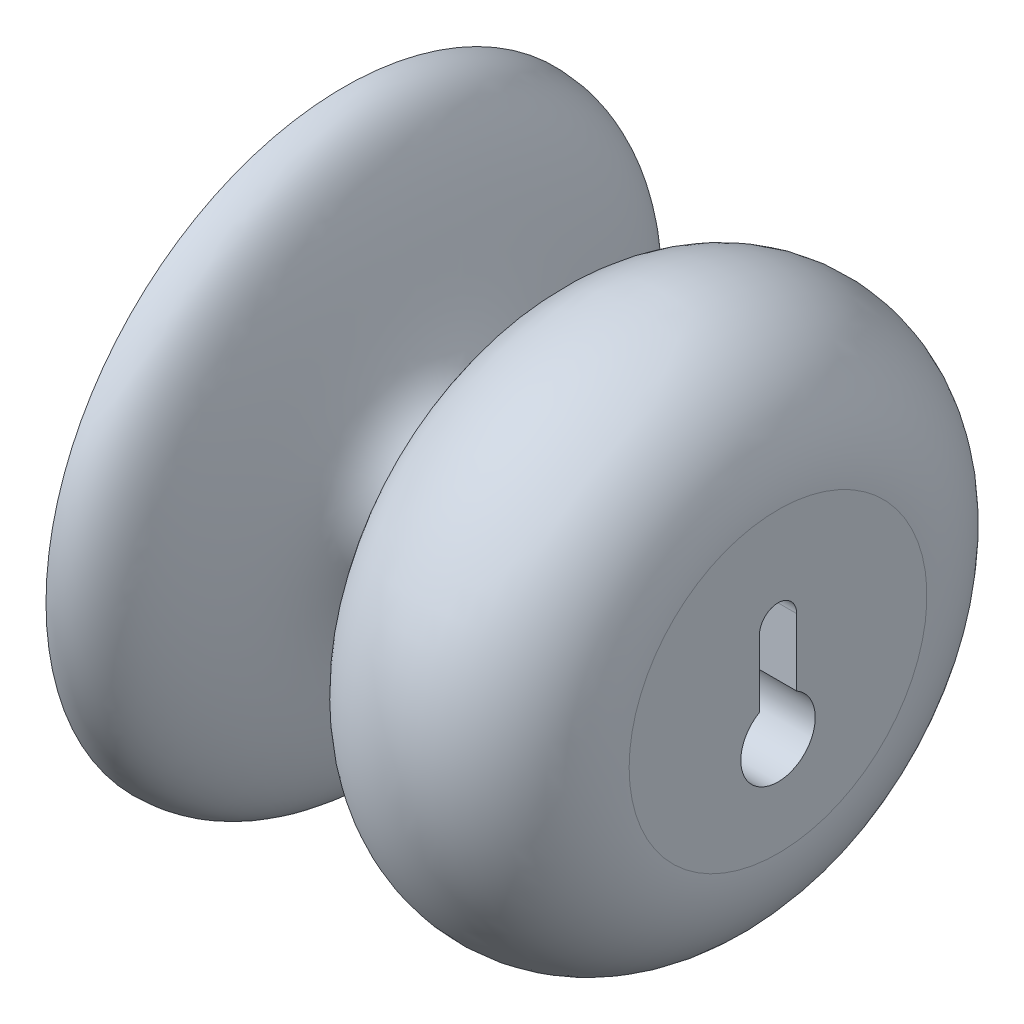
ISO-10303-21;
HEADER;
FILE_DESCRIPTION(('STEP AP214'),'2;1');
FILE_NAME('part.step','',(''),(''),'','','');
FILE_SCHEMA(('AUTOMOTIVE_DESIGN { 1 0 10303 214 1 1 1 1 }'));
ENDSEC;
DATA;
#1=APPLICATION_CONTEXT('core data for automotive mechanical design processes');
#2=APPLICATION_PROTOCOL_DEFINITION('international standard','automotive_design',2000,#1);
#3=PRODUCT_CONTEXT('',#1,'mechanical');
#4=PRODUCT('Part','Part','',(#3));
#5=PRODUCT_RELATED_PRODUCT_CATEGORY('part','',(#4));
#6=PRODUCT_DEFINITION_FORMATION('','',#4);
#7=PRODUCT_DEFINITION_CONTEXT('part definition',#1,'design');
#8=PRODUCT_DEFINITION('design','',#6,#7);
#9=PRODUCT_DEFINITION_SHAPE('','',#8);
#10=(LENGTH_UNIT() NAMED_UNIT(*) SI_UNIT(.MILLI.,.METRE.));
#11=(NAMED_UNIT(*) PLANE_ANGLE_UNIT() SI_UNIT($,.RADIAN.));
#12=(NAMED_UNIT(*) SI_UNIT($,.STERADIAN.) SOLID_ANGLE_UNIT());
#13=UNCERTAINTY_MEASURE_WITH_UNIT(LENGTH_MEASURE(1.E-05),#10,'distance_accuracy_value','');
#14=(GEOMETRIC_REPRESENTATION_CONTEXT(3) GLOBAL_UNCERTAINTY_ASSIGNED_CONTEXT((#13)) GLOBAL_UNIT_ASSIGNED_CONTEXT((#10,
#11,#12)) REPRESENTATION_CONTEXT('',''));
#15=CARTESIAN_POINT('',(0.,0.,0.));
#16=DIRECTION('',(0.,0.,1.));
#17=DIRECTION('',(1.,0.,0.));
#18=AXIS2_PLACEMENT_3D('',#15,#16,#17);
#19=CARTESIAN_POINT('',(0.,0.,0.));
#20=DIRECTION('',(-1.,0.,0.));
#21=DIRECTION('',(0.,0.,1.));
#22=AXIS2_PLACEMENT_3D('',#19,#20,#21);
#23=PLANE('',#22);
#24=CARTESIAN_POINT('',(0.,-5.08,0.));
#25=DIRECTION('',(1.,0.,0.));
#26=DIRECTION('',(0.,0.,-1.));
#27=AXIS2_PLACEMENT_3D('',#24,#25,#26);
#28=CIRCLE('',#27,3.81);
#29=CARTESIAN_POINT('',(0.,-1.78044321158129,1.905));
#30=VERTEX_POINT('',#29);
#31=CARTESIAN_POINT('',(0.,-1.78044321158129,-1.905));
#32=VERTEX_POINT('',#31);
#33=EDGE_CURVE('E119',#30,#32,#28,.T.);
#34=ORIENTED_EDGE('',*,*,#33,.F.);
#35=DIRECTION('',(0.,-1.,0.));
#36=VECTOR('',#35,1.);
#37=CARTESIAN_POINT('',(0.,0.,1.905));
#38=LINE('',#37,#36);
#39=CARTESIAN_POINT('',(0.,5.08,1.905));
#40=VERTEX_POINT('',#39);
#41=EDGE_CURVE('E50',#40,#30,#38,.T.);
#42=ORIENTED_EDGE('',*,*,#41,.F.);
#43=CARTESIAN_POINT('',(0.,5.08,0.));
#44=DIRECTION('',(1.,0.,0.));
#45=DIRECTION('',(0.,0.,-1.));
#46=AXIS2_PLACEMENT_3D('',#43,#44,#45);
#47=CIRCLE('',#46,1.905);
#48=CARTESIAN_POINT('',(0.,5.08,-1.905));
#49=VERTEX_POINT('',#48);
#50=EDGE_CURVE('E108',#49,#40,#47,.T.);
#51=ORIENTED_EDGE('',*,*,#50,.F.);
#52=DIRECTION('',(0.,-1.,0.));
#53=VECTOR('',#52,1.);
#54=CARTESIAN_POINT('',(0.,0.,-1.905));
#55=LINE('',#54,#53);
#56=EDGE_CURVE('E111',#49,#32,#55,.T.);
#57=ORIENTED_EDGE('',*,*,#56,.T.);
#58=EDGE_LOOP('',(#34,#42,#51,#57));
#59=FACE_BOUND('',#58,.T.);
#60=CARTESIAN_POINT('',(0.,0.,0.));
#61=DIRECTION('',(-1.,0.,0.));
#62=DIRECTION('',(0.,0.,1.));
#63=AXIS2_PLACEMENT_3D('',#60,#61,#62);
#64=CIRCLE('',#63,15.24);
#65=CARTESIAN_POINT('',(0.,0.,15.24));
#66=VERTEX_POINT('',#65);
#67=EDGE_CURVE('E125',#66,#66,#64,.T.);
#68=ORIENTED_EDGE('',*,*,#67,.F.);
#69=EDGE_LOOP('',(#68));
#70=FACE_BOUND('',#69,.T.);
#71=ADVANCED_FACE('F36',(#59,#70),#23,.F.);
#72=CARTESIAN_POINT('',(-44.45,0.,0.));
#73=DIRECTION('',(1.,0.,0.));
#74=DIRECTION('',(0.,0.,-1.));
#75=AXIS2_PLACEMENT_3D('',#72,#73,#74);
#76=PLANE('',#75);
#77=CARTESIAN_POINT('',(-44.45,0.,0.));
#78=DIRECTION('',(-1.,0.,0.));
#79=DIRECTION('',(0.,0.,1.));
#80=AXIS2_PLACEMENT_3D('',#77,#78,#79);
#81=CIRCLE('',#80,30.48);
#82=CARTESIAN_POINT('',(-44.45,0.,30.48));
#83=VERTEX_POINT('',#82);
#84=EDGE_CURVE('E153',#83,#83,#81,.T.);
#85=ORIENTED_EDGE('',*,*,#84,.T.);
#86=EDGE_LOOP('',(#85));
#87=FACE_BOUND('',#86,.T.);
#88=ADVANCED_FACE('F142',(#87),#76,.F.);
#89=CARTESIAN_POINT('',(-25.4,6.35,0.));
#90=CARTESIAN_POINT('',(-29.5218592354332,6.35,0.));
#91=CARTESIAN_POINT('',(-35.0906794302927,8.98645168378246,0.));
#92=CARTESIAN_POINT('',(-37.2171157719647,19.5472011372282,0.));
#93=CARTESIAN_POINT('',(-39.1654387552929,30.48,0.));
#94=CARTESIAN_POINT('',(-44.45,30.48,0.));
#95=B_SPLINE_CURVE_WITH_KNOTS('',3,(#89,#90,#91,#92,#93,#94),.UNSPECIFIED.,.F.,.F.,(4,1,1,4),
(0.,0.297465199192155,0.544496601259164,1.),.UNSPECIFIED.);
#96=CARTESIAN_POINT('',(-44.45,0.,0.));
#97=DIRECTION('',(-1.,0.,0.));
#98=AXIS1_PLACEMENT('',#96,#97);
#99=SURFACE_OF_REVOLUTION('',#95,#98);
#100=ORIENTED_EDGE('',*,*,#84,.F.);
#101=EDGE_LOOP('',(#100));
#102=FACE_BOUND('',#101,.T.);
#103=CARTESIAN_POINT('',(-25.4,0.,0.));
#104=DIRECTION('',(-1.,0.,0.));
#105=DIRECTION('',(0.,0.,1.));
#106=AXIS2_PLACEMENT_3D('',#103,#104,#105);
#107=CIRCLE('',#106,6.35);
#108=CARTESIAN_POINT('',(-25.4,6.1515625,1.57504882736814));
#109=VERTEX_POINT('',#108);
#110=CARTESIAN_POINT('',(-25.4,6.1515625,-1.57504882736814));
#111=VERTEX_POINT('',#110);
#112=EDGE_CURVE('E154',#109,#111,#107,.T.);
#113=ORIENTED_EDGE('',*,*,#112,.T.);
#114=CARTESIAN_POINT('',(-25.4,-5.08,-3.81));
#115=VERTEX_POINT('',#114);
#116=EDGE_CURVE('E157',#111,#115,#107,.T.);
#117=ORIENTED_EDGE('',*,*,#116,.T.);
#118=CARTESIAN_POINT('',(-25.4,-5.08,3.81));
#119=VERTEX_POINT('',#118);
#120=EDGE_CURVE('E165',#115,#119,#107,.T.);
#121=ORIENTED_EDGE('',*,*,#120,.T.);
#122=EDGE_CURVE('E159',#119,#109,#107,.T.);
#123=ORIENTED_EDGE('',*,*,#122,.T.);
#124=EDGE_LOOP('',(#113,#117,#121,#123));
#125=FACE_BOUND('',#124,.T.);
#126=ADVANCED_FACE('F138',(#102,#125),#99,.T.);
#127=CARTESIAN_POINT('',(-25.4,15.24,0.));
#128=DIRECTION('',(1.,0.,0.));
#129=DIRECTION('',(0.,0.,-1.));
#130=AXIS2_PLACEMENT_3D('',#127,#128,#129);
#131=PLANE('',#130);
#132=ORIENTED_EDGE('',*,*,#116,.F.);
#133=CARTESIAN_POINT('',(-25.4,5.08,0.));
#134=DIRECTION('',(1.,0.,0.));
#135=DIRECTION('',(0.,0.,-1.));
#136=AXIS2_PLACEMENT_3D('',#133,#134,#135);
#137=CIRCLE('',#136,1.905);
#138=EDGE_CURVE('E11',#111,#109,#137,.T.);
#139=ORIENTED_EDGE('',*,*,#138,.T.);
#140=ORIENTED_EDGE('',*,*,#122,.F.);
#141=CARTESIAN_POINT('',(-25.4,-5.08,0.));
#142=DIRECTION('',(1.,0.,0.));
#143=DIRECTION('',(0.,0.,-1.));
#144=AXIS2_PLACEMENT_3D('',#141,#142,#143);
#145=CIRCLE('',#144,3.81);
#146=EDGE_CURVE('E43',#119,#115,#145,.T.);
#147=ORIENTED_EDGE('',*,*,#146,.T.);
#148=EDGE_LOOP('',(#132,#139,#140,#147));
#149=FACE_BOUND('',#148,.T.);
#150=CARTESIAN_POINT('',(-25.4,0.,0.));
#151=DIRECTION('',(-1.,0.,0.));
#152=DIRECTION('',(0.,0.,1.));
#153=AXIS2_PLACEMENT_3D('',#150,#151,#152);
#154=CIRCLE('',#153,15.24);
#155=CARTESIAN_POINT('',(-25.4,0.,15.24));
#156=VERTEX_POINT('',#155);
#157=EDGE_CURVE('E160',#156,#156,#154,.T.);
#158=ORIENTED_EDGE('',*,*,#157,.T.);
#159=EDGE_LOOP('',(#158));
#160=FACE_BOUND('',#159,.T.);
#161=ADVANCED_FACE('F141',(#149,#160),#131,.F.);
#162=CARTESIAN_POINT('',(-12.7,0.,0.));
#163=DIRECTION('',(-1.,0.,0.));
#164=DIRECTION('',(0.,0.,1.));
#165=AXIS2_PLACEMENT_3D('',#162,#163,#164);
#166=TOROIDAL_SURFACE('',#165,15.24,12.7);
#167=ORIENTED_EDGE('',*,*,#157,.F.);
#168=EDGE_LOOP('',(#167));
#169=FACE_BOUND('',#168,.T.);
#170=ORIENTED_EDGE('',*,*,#67,.T.);
#171=EDGE_LOOP('',(#170));
#172=FACE_BOUND('',#171,.T.);
#173=ADVANCED_FACE('F169',(#169,#172),#166,.T.);
#174=CARTESIAN_POINT('',(-25.4,0.,0.));
#175=DIRECTION('',(1.,0.,0.));
#176=DIRECTION('',(0.,0.,-1.));
#177=AXIS2_PLACEMENT_3D('',#174,#175,#176);
#178=PLANE('',#177);
#179=ORIENTED_EDGE('',*,*,#120,.F.);
#180=CARTESIAN_POINT('',(-25.4,-5.08,0.));
#181=DIRECTION('',(1.,0.,0.));
#182=DIRECTION('',(0.,0.,-1.));
#183=AXIS2_PLACEMENT_3D('',#180,#181,#182);
#184=CIRCLE('',#183,3.81);
#185=CARTESIAN_POINT('',(-25.4,-1.78044321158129,-1.905));
#186=VERTEX_POINT('',#185);
#187=EDGE_CURVE('E58',#115,#186,#184,.T.);
#188=ORIENTED_EDGE('',*,*,#187,.T.);
#189=DIRECTION('',(0.,-1.,0.));
#190=VECTOR('',#189,1.);
#191=CARTESIAN_POINT('',(-25.4,0.,-1.905));
#192=LINE('',#191,#190);
#193=CARTESIAN_POINT('',(-25.4,5.08,-1.905));
#194=VERTEX_POINT('',#193);
#195=EDGE_CURVE('E102',#194,#186,#192,.T.);
#196=ORIENTED_EDGE('',*,*,#195,.F.);
#197=CARTESIAN_POINT('',(-25.4,5.08,0.));
#198=DIRECTION('',(1.,0.,0.));
#199=DIRECTION('',(0.,0.,-1.));
#200=AXIS2_PLACEMENT_3D('',#197,#198,#199);
#201=CIRCLE('',#200,1.905);
#202=EDGE_CURVE('E94',#194,#111,#201,.T.);
#203=ORIENTED_EDGE('',*,*,#202,.T.);
#204=ORIENTED_EDGE('',*,*,#112,.F.);
#205=CARTESIAN_POINT('',(-25.4,5.08,1.905));
#206=VERTEX_POINT('',#205);
#207=EDGE_CURVE('E106',#109,#206,#201,.T.);
#208=ORIENTED_EDGE('',*,*,#207,.T.);
#209=DIRECTION('',(0.,-1.,0.));
#210=VECTOR('',#209,1.);
#211=CARTESIAN_POINT('',(-25.4,0.,1.905));
#212=LINE('',#211,#210);
#213=CARTESIAN_POINT('',(-25.4,-1.78044321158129,1.905));
#214=VERTEX_POINT('',#213);
#215=EDGE_CURVE('E90',#206,#214,#212,.T.);
#216=ORIENTED_EDGE('',*,*,#215,.T.);
#217=EDGE_CURVE('E97',#214,#119,#184,.T.);
#218=ORIENTED_EDGE('',*,*,#217,.T.);
#219=EDGE_LOOP('',(#179,#188,#196,#203,#204,#208,#216,#218));
#220=FACE_BOUND('',#219,.T.);
#221=ADVANCED_FACE('F104',(#220),#178,.T.);
#222=CARTESIAN_POINT('',(-25.4,0.,1.905));
#223=DIRECTION('',(0.,0.,1.));
#224=DIRECTION('',(0.,-1.,0.));
#225=AXIS2_PLACEMENT_3D('',#222,#223,#224);
#226=PLANE('',#225);
#227=ORIENTED_EDGE('',*,*,#41,.T.);
#228=DIRECTION('',(1.,0.,0.));
#229=VECTOR('',#228,1.);
#230=CARTESIAN_POINT('',(-25.4,-1.78044321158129,1.905));
#231=LINE('',#230,#229);
#232=EDGE_CURVE('E86',#214,#30,#231,.T.);
#233=ORIENTED_EDGE('',*,*,#232,.F.);
#234=ORIENTED_EDGE('',*,*,#215,.F.);
#235=DIRECTION('',(1.,0.,0.));
#236=VECTOR('',#235,1.);
#237=CARTESIAN_POINT('',(-25.4,5.08,1.905));
#238=LINE('',#237,#236);
#239=EDGE_CURVE('E123',#206,#40,#238,.T.);
#240=ORIENTED_EDGE('',*,*,#239,.T.);
#241=EDGE_LOOP('',(#227,#233,#234,#240));
#242=FACE_BOUND('',#241,.T.);
#243=ADVANCED_FACE('F88',(#242),#226,.F.);
#244=CARTESIAN_POINT('',(-25.4,5.08,0.));
#245=DIRECTION('',(1.,0.,0.));
#246=DIRECTION('',(0.,0.,-1.));
#247=AXIS2_PLACEMENT_3D('',#244,#245,#246);
#248=CYLINDRICAL_SURFACE('',#247,1.905);
#249=ORIENTED_EDGE('',*,*,#50,.T.);
#250=ORIENTED_EDGE('',*,*,#239,.F.);
#251=ORIENTED_EDGE('',*,*,#207,.F.);
#252=ORIENTED_EDGE('',*,*,#138,.F.);
#253=ORIENTED_EDGE('',*,*,#202,.F.);
#254=DIRECTION('',(1.,0.,0.));
#255=VECTOR('',#254,1.);
#256=CARTESIAN_POINT('',(-25.4,5.08,-1.905));
#257=LINE('',#256,#255);
#258=EDGE_CURVE('E126',#194,#49,#257,.T.);
#259=ORIENTED_EDGE('',*,*,#258,.T.);
#260=EDGE_LOOP('',(#249,#250,#251,#252,#253,#259));
#261=FACE_BOUND('',#260,.T.);
#262=ADVANCED_FACE('F182',(#261),#248,.F.);
#263=CARTESIAN_POINT('',(-25.4,0.,-1.905));
#264=DIRECTION('',(0.,0.,1.));
#265=DIRECTION('',(1.,0.,0.));
#266=AXIS2_PLACEMENT_3D('',#263,#264,#265);
#267=PLANE('',#266);
#268=ORIENTED_EDGE('',*,*,#56,.F.);
#269=ORIENTED_EDGE('',*,*,#258,.F.);
#270=ORIENTED_EDGE('',*,*,#195,.T.);
#271=DIRECTION('',(1.,0.,0.));
#272=VECTOR('',#271,1.);
#273=CARTESIAN_POINT('',(-25.4,-1.78044321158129,-1.905));
#274=LINE('',#273,#272);
#275=EDGE_CURVE('E93',#186,#32,#274,.T.);
#276=ORIENTED_EDGE('',*,*,#275,.T.);
#277=EDGE_LOOP('',(#268,#269,#270,#276));
#278=FACE_BOUND('',#277,.T.);
#279=ADVANCED_FACE('F185',(#278),#267,.T.);
#280=CARTESIAN_POINT('',(-25.4,-5.08,0.));
#281=DIRECTION('',(1.,0.,0.));
#282=DIRECTION('',(0.,0.,-1.));
#283=AXIS2_PLACEMENT_3D('',#280,#281,#282);
#284=CYLINDRICAL_SURFACE('',#283,3.81);
#285=ORIENTED_EDGE('',*,*,#33,.T.);
#286=ORIENTED_EDGE('',*,*,#275,.F.);
#287=ORIENTED_EDGE('',*,*,#187,.F.);
#288=ORIENTED_EDGE('',*,*,#146,.F.);
#289=ORIENTED_EDGE('',*,*,#217,.F.);
#290=ORIENTED_EDGE('',*,*,#232,.T.);
#291=EDGE_LOOP('',(#285,#286,#287,#288,#289,#290));
#292=FACE_BOUND('',#291,.T.);
#293=ADVANCED_FACE('F98',(#292),#284,.F.);
#294=CLOSED_SHELL('',(#71,#88,#126,#161,#173,#221,#243,#262,#279,#293));
#295=MANIFOLD_SOLID_BREP('B2',#294);
#296=ADVANCED_BREP_SHAPE_REPRESENTATION('',(#18,#295),#14);
#297=SHAPE_DEFINITION_REPRESENTATION(#9,#296);
ENDSEC;
END-ISO-10303-21;
